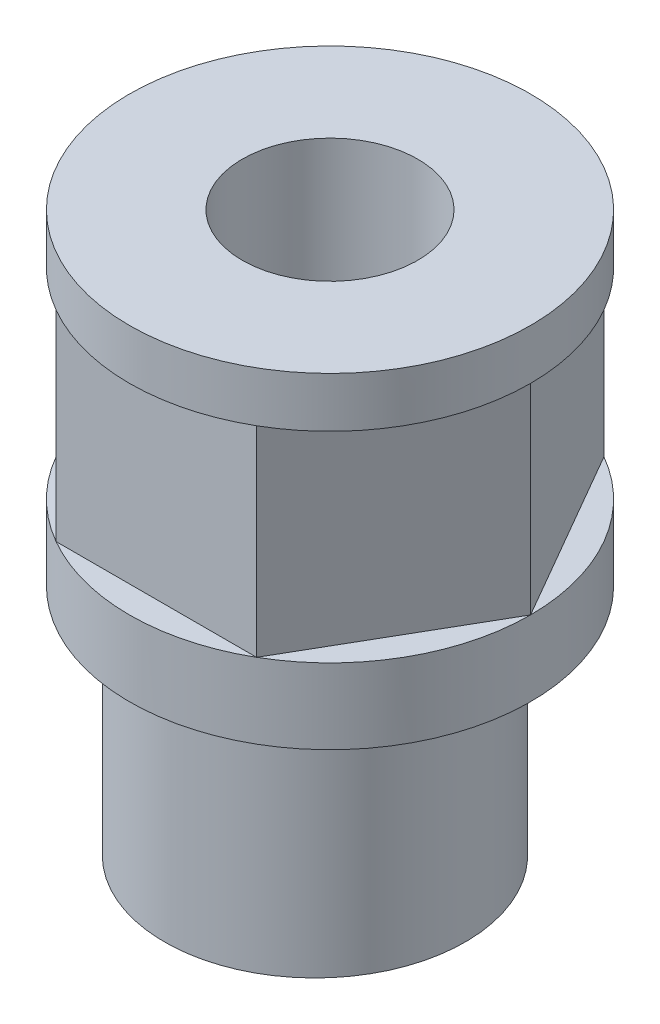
from build123d import *

# Parameters (mm, degrees)
BOSS_EXTRUDE1_DEPTH = 5.08
SKETCH2_R           = 10.16
BOSS_EXTRUDE2_DEPTH = 2.54
BOSS_EXTRUDE3_START = 3.81
SKETCH3_R           = 10.16
BOSS_EXTRUDE3_DEPTH = 3.81
SKETCH4_R           = 7.62
BOSS_EXTRUDE4_DEPTH = 11.43
SKETCH5_R           = 4.445
CUT_EXTRUDE1_DEPTH  = 31.242


with BuildPart() as part:
    # Sketch1 → Boss-Extrude1 (new, symmetric)
    with BuildSketch(Plane(origin=(0, 0, 0), x_dir=(1, 0, 0), z_dir=(0, 1, 0))):
        Polygon((10.16, 0), (5.08, 8.798818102), (-5.08, 8.798818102), (-10.16, 0), (-5.08, -8.798818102), (5.08, -8.798818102), align=None)
    extrude(amount=BOSS_EXTRUDE1_DEPTH, both=True)

    # Sketch2 → Boss-Extrude2 (add)
    with BuildSketch(Plane(origin=(0, 5.08, 0), x_dir=(1, 0, 0), z_dir=(0, 1, 0))):
        with Locations(Location((0, 0, 0), (0, 0, 60))):
            Circle(SKETCH2_R)
    extrude(amount=BOSS_EXTRUDE2_DEPTH)

    # Sketch3 → Boss-Extrude3 (add)
    with BuildSketch(Plane.XZ.offset(5.08).offset(BOSS_EXTRUDE3_START)):
        with Locations(Location((0, 0, 0), (0, 0, 300))):
            Circle(SKETCH3_R)
    extrude(amount=-BOSS_EXTRUDE3_DEPTH)

    # Sketch4 → Boss-Extrude4 (add)
    with BuildSketch(Plane.XZ.offset(8.89)):
        with Locations(Location((0, 0.762, 0), (0, 0, 270))):
            Circle(SKETCH4_R)
    extrude(amount=BOSS_EXTRUDE4_DEPTH)

    # Sketch5 → Cut-Extrude1 (cut)
    with BuildSketch(Plane(origin=(0, 7.62, 0), x_dir=(1, 0, 0), z_dir=(0, 1, 0))):
        with Locations(Location((0, 0, 0), (0, 0, 270))):
            Circle(SKETCH5_R)
    extrude(amount=-CUT_EXTRUDE1_DEPTH, mode=Mode.SUBTRACT)


solid = part.part
